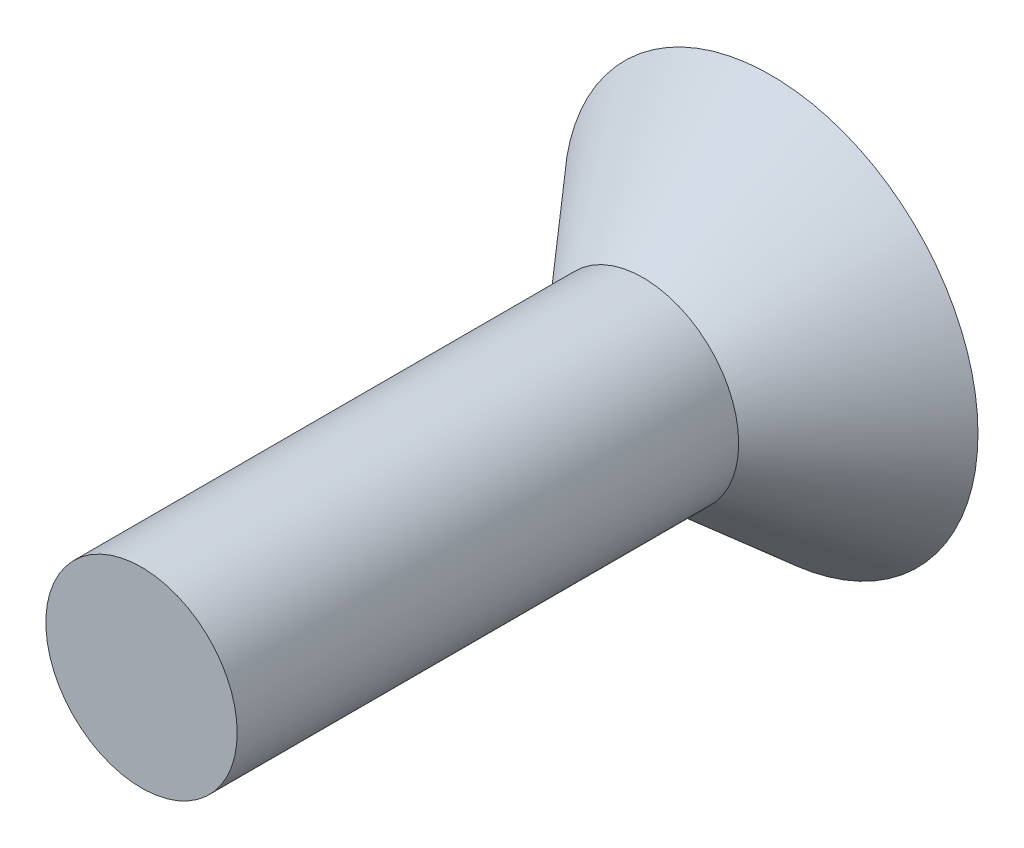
ISO-10303-21;
HEADER;
FILE_DESCRIPTION(('STEP AP214'),'2;1');
FILE_NAME('part.step','',(''),(''),'','','');
FILE_SCHEMA(('AUTOMOTIVE_DESIGN { 1 0 10303 214 1 1 1 1 }'));
ENDSEC;
DATA;
#1=APPLICATION_CONTEXT('core data for automotive mechanical design processes');
#2=APPLICATION_PROTOCOL_DEFINITION('international standard','automotive_design',2000,#1);
#3=PRODUCT_CONTEXT('',#1,'mechanical');
#4=PRODUCT('Part','Part','',(#3));
#5=PRODUCT_RELATED_PRODUCT_CATEGORY('part','',(#4));
#6=PRODUCT_DEFINITION_FORMATION('','',#4);
#7=PRODUCT_DEFINITION_CONTEXT('part definition',#1,'design');
#8=PRODUCT_DEFINITION('design','',#6,#7);
#9=PRODUCT_DEFINITION_SHAPE('','',#8);
#10=(LENGTH_UNIT() NAMED_UNIT(*) SI_UNIT(.MILLI.,.METRE.));
#11=(NAMED_UNIT(*) PLANE_ANGLE_UNIT() SI_UNIT($,.RADIAN.));
#12=(NAMED_UNIT(*) SI_UNIT($,.STERADIAN.) SOLID_ANGLE_UNIT());
#13=UNCERTAINTY_MEASURE_WITH_UNIT(LENGTH_MEASURE(1.E-05),#10,'distance_accuracy_value','');
#14=(GEOMETRIC_REPRESENTATION_CONTEXT(3) GLOBAL_UNCERTAINTY_ASSIGNED_CONTEXT((#13)) GLOBAL_UNIT_ASSIGNED_CONTEXT((#10,
#11,#12)) REPRESENTATION_CONTEXT('',''));
#15=CARTESIAN_POINT('',(0.,0.,0.));
#16=DIRECTION('',(0.,0.,1.));
#17=DIRECTION('',(1.,0.,0.));
#18=AXIS2_PLACEMENT_3D('',#15,#16,#17);
#19=CARTESIAN_POINT('',(0.,-5.2197,0.));
#20=DIRECTION('',(0.,0.,-1.));
#21=DIRECTION('',(-1.,0.,0.));
#22=AXIS2_PLACEMENT_3D('',#19,#20,#21);
#23=PLANE('',#22);
#24=DIRECTION('',(0.866025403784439,-0.5,0.));
#25=VECTOR('',#24,1.);
#26=CARTESIAN_POINT('',(0.,1.83308710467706,0.));
#27=LINE('',#26,#25);
#28=CARTESIAN_POINT('',(0.,1.83308710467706,0.));
#29=VERTEX_POINT('',#28);
#30=CARTESIAN_POINT('',(1.5875,0.916543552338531,0.));
#31=VERTEX_POINT('',#30);
#32=EDGE_CURVE('E46',#29,#31,#27,.T.);
#33=ORIENTED_EDGE('',*,*,#32,.F.);
#34=DIRECTION('',(0.866025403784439,0.5,0.));
#35=VECTOR('',#34,1.);
#36=CARTESIAN_POINT('',(-1.5875,0.916543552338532,0.));
#37=LINE('',#36,#35);
#38=CARTESIAN_POINT('',(-1.5875,0.916543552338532,0.));
#39=VERTEX_POINT('',#38);
#40=EDGE_CURVE('E129',#39,#29,#37,.T.);
#41=ORIENTED_EDGE('',*,*,#40,.F.);
#42=DIRECTION('',(0.,1.,0.));
#43=VECTOR('',#42,1.);
#44=CARTESIAN_POINT('',(-1.5875,-0.916543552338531,0.));
#45=LINE('',#44,#43);
#46=CARTESIAN_POINT('',(-1.5875,-0.916543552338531,0.));
#47=VERTEX_POINT('',#46);
#48=EDGE_CURVE('E127',#47,#39,#45,.T.);
#49=ORIENTED_EDGE('',*,*,#48,.F.);
#50=DIRECTION('',(-0.866025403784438,0.5,0.));
#51=VECTOR('',#50,1.);
#52=CARTESIAN_POINT('',(0.,-1.83308710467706,0.));
#53=LINE('',#52,#51);
#54=CARTESIAN_POINT('',(0.,-1.83308710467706,0.));
#55=VERTEX_POINT('',#54);
#56=EDGE_CURVE('E94',#55,#47,#53,.T.);
#57=ORIENTED_EDGE('',*,*,#56,.F.);
#58=DIRECTION('',(-0.866025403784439,-0.5,0.));
#59=VECTOR('',#58,1.);
#60=CARTESIAN_POINT('',(1.5875,-0.916543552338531,0.));
#61=LINE('',#60,#59);
#62=CARTESIAN_POINT('',(1.5875,-0.916543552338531,0.));
#63=VERTEX_POINT('',#62);
#64=EDGE_CURVE('E123',#63,#55,#61,.T.);
#65=ORIENTED_EDGE('',*,*,#64,.F.);
#66=DIRECTION('',(0.,-1.,0.));
#67=VECTOR('',#66,1.);
#68=CARTESIAN_POINT('',(1.5875,0.916543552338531,0.));
#69=LINE('',#68,#67);
#70=EDGE_CURVE('E120',#31,#63,#69,.T.);
#71=ORIENTED_EDGE('',*,*,#70,.F.);
#72=EDGE_LOOP('',(#33,#41,#49,#57,#65,#71));
#73=FACE_BOUND('',#72,.T.);
#74=CARTESIAN_POINT('',(0.,0.,0.));
#75=DIRECTION('',(0.,0.,1.));
#76=DIRECTION('',(1.,0.,0.));
#77=AXIS2_PLACEMENT_3D('',#74,#75,#76);
#78=CIRCLE('',#77,5.2197);
#79=CARTESIAN_POINT('',(5.2197,0.,0.));
#80=VERTEX_POINT('',#79);
#81=EDGE_CURVE('E11',#80,#80,#78,.T.);
#82=ORIENTED_EDGE('',*,*,#81,.F.);
#83=EDGE_LOOP('',(#82));
#84=FACE_BOUND('',#83,.T.);
#85=ADVANCED_FACE('F32',(#73,#84),#23,.T.);
#86=CARTESIAN_POINT('',(0.,0.,3.2287390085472));
#87=DIRECTION('',(0.,0.,-1.));
#88=DIRECTION('',(-1.,0.,0.));
#89=AXIS2_PLACEMENT_3D('',#86,#87,#88);
#90=CONICAL_SURFACE('',#89,2.413,0.715584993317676);
#91=ORIENTED_EDGE('',*,*,#81,.T.);
#92=EDGE_LOOP('',(#91));
#93=FACE_BOUND('',#92,.T.);
#94=CARTESIAN_POINT('',(0.,0.,3.2287390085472));
#95=DIRECTION('',(0.,0.,1.));
#96=DIRECTION('',(1.,0.,0.));
#97=AXIS2_PLACEMENT_3D('',#94,#95,#96);
#98=CIRCLE('',#97,2.413);
#99=CARTESIAN_POINT('',(2.413,0.,3.2287390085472));
#100=VERTEX_POINT('',#99);
#101=EDGE_CURVE('E39',#100,#100,#98,.T.);
#102=ORIENTED_EDGE('',*,*,#101,.F.);
#103=EDGE_LOOP('',(#102));
#104=FACE_BOUND('',#103,.T.);
#105=ADVANCED_FACE('F146',(#93,#104),#90,.T.);
#106=CARTESIAN_POINT('',(0.,0.,15.875));
#107=DIRECTION('',(0.,0.,1.));
#108=DIRECTION('',(1.,0.,0.));
#109=AXIS2_PLACEMENT_3D('',#106,#107,#108);
#110=CYLINDRICAL_SURFACE('',#109,2.413);
#111=ORIENTED_EDGE('',*,*,#101,.T.);
#112=EDGE_LOOP('',(#111));
#113=FACE_BOUND('',#112,.T.);
#114=CARTESIAN_POINT('',(0.,0.,15.875));
#115=DIRECTION('',(0.,0.,1.));
#116=DIRECTION('',(1.,0.,0.));
#117=AXIS2_PLACEMENT_3D('',#114,#115,#116);
#118=CIRCLE('',#117,2.413);
#119=CARTESIAN_POINT('',(2.413,0.,15.875));
#120=VERTEX_POINT('',#119);
#121=EDGE_CURVE('E133',#120,#120,#118,.T.);
#122=ORIENTED_EDGE('',*,*,#121,.F.);
#123=EDGE_LOOP('',(#122));
#124=FACE_BOUND('',#123,.T.);
#125=ADVANCED_FACE('F143',(#113,#124),#110,.T.);
#126=CARTESIAN_POINT('',(0.,0.,15.875));
#127=DIRECTION('',(0.,0.,1.));
#128=DIRECTION('',(1.,0.,0.));
#129=AXIS2_PLACEMENT_3D('',#126,#127,#128);
#130=PLANE('',#129);
#131=ORIENTED_EDGE('',*,*,#121,.T.);
#132=EDGE_LOOP('',(#131));
#133=FACE_BOUND('',#132,.T.);
#134=ADVANCED_FACE('F153',(#133),#130,.T.);
#135=CARTESIAN_POINT('',(0.,1.83308710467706,3.048));
#136=DIRECTION('',(0.5,0.866025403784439,0.));
#137=DIRECTION('',(-0.866025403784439,0.5,0.));
#138=AXIS2_PLACEMENT_3D('',#135,#136,#137);
#139=PLANE('',#138);
#140=ORIENTED_EDGE('',*,*,#32,.T.);
#141=DIRECTION('',(0.,0.,-1.));
#142=VECTOR('',#141,1.);
#143=CARTESIAN_POINT('',(1.5875,0.916543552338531,3.048));
#144=LINE('',#143,#142);
#145=CARTESIAN_POINT('',(1.5875,0.916543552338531,3.048));
#146=VERTEX_POINT('',#145);
#147=EDGE_CURVE('E76',#146,#31,#144,.T.);
#148=ORIENTED_EDGE('',*,*,#147,.F.);
#149=DIRECTION('',(0.866025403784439,-0.5,0.));
#150=VECTOR('',#149,1.);
#151=CARTESIAN_POINT('',(0.,1.83308710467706,3.048));
#152=LINE('',#151,#150);
#153=CARTESIAN_POINT('',(0.,1.83308710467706,3.048));
#154=VERTEX_POINT('',#153);
#155=EDGE_CURVE('E131',#154,#146,#152,.T.);
#156=ORIENTED_EDGE('',*,*,#155,.F.);
#157=DIRECTION('',(0.,0.,-1.));
#158=VECTOR('',#157,1.);
#159=CARTESIAN_POINT('',(0.,1.83308710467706,3.048));
#160=LINE('',#159,#158);
#161=EDGE_CURVE('E54',#154,#29,#160,.T.);
#162=ORIENTED_EDGE('',*,*,#161,.T.);
#163=EDGE_LOOP('',(#140,#148,#156,#162));
#164=FACE_BOUND('',#163,.T.);
#165=ADVANCED_FACE('F159',(#164),#139,.F.);
#166=CARTESIAN_POINT('',(-1.5875,0.916543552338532,3.048));
#167=DIRECTION('',(-0.5,0.866025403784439,0.));
#168=DIRECTION('',(-0.866025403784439,-0.5,0.));
#169=AXIS2_PLACEMENT_3D('',#166,#167,#168);
#170=PLANE('',#169);
#171=ORIENTED_EDGE('',*,*,#40,.T.);
#172=ORIENTED_EDGE('',*,*,#161,.F.);
#173=DIRECTION('',(0.866025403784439,0.5,0.));
#174=VECTOR('',#173,1.);
#175=CARTESIAN_POINT('',(-1.5875,0.916543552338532,3.048));
#176=LINE('',#175,#174);
#177=CARTESIAN_POINT('',(-1.5875,0.916543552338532,3.048));
#178=VERTEX_POINT('',#177);
#179=EDGE_CURVE('E106',#178,#154,#176,.T.);
#180=ORIENTED_EDGE('',*,*,#179,.F.);
#181=DIRECTION('',(0.,0.,-1.));
#182=VECTOR('',#181,1.);
#183=CARTESIAN_POINT('',(-1.5875,0.916543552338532,3.048));
#184=LINE('',#183,#182);
#185=EDGE_CURVE('E98',#178,#39,#184,.T.);
#186=ORIENTED_EDGE('',*,*,#185,.T.);
#187=EDGE_LOOP('',(#171,#172,#180,#186));
#188=FACE_BOUND('',#187,.T.);
#189=ADVANCED_FACE('F163',(#188),#170,.F.);
#190=CARTESIAN_POINT('',(-1.5875,-0.916543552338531,3.048));
#191=DIRECTION('',(-1.,0.,0.));
#192=DIRECTION('',(0.,-1.,0.));
#193=AXIS2_PLACEMENT_3D('',#190,#191,#192);
#194=PLANE('',#193);
#195=ORIENTED_EDGE('',*,*,#48,.T.);
#196=ORIENTED_EDGE('',*,*,#185,.F.);
#197=DIRECTION('',(0.,1.,0.));
#198=VECTOR('',#197,1.);
#199=CARTESIAN_POINT('',(-1.5875,-0.916543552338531,3.048));
#200=LINE('',#199,#198);
#201=CARTESIAN_POINT('',(-1.5875,-0.916543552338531,3.048));
#202=VERTEX_POINT('',#201);
#203=EDGE_CURVE('E102',#202,#178,#200,.T.);
#204=ORIENTED_EDGE('',*,*,#203,.F.);
#205=DIRECTION('',(0.,0.,-1.));
#206=VECTOR('',#205,1.);
#207=CARTESIAN_POINT('',(-1.5875,-0.916543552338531,3.048));
#208=LINE('',#207,#206);
#209=EDGE_CURVE('E87',#202,#47,#208,.T.);
#210=ORIENTED_EDGE('',*,*,#209,.T.);
#211=EDGE_LOOP('',(#195,#196,#204,#210));
#212=FACE_BOUND('',#211,.T.);
#213=ADVANCED_FACE('F103',(#212),#194,.F.);
#214=CARTESIAN_POINT('',(0.,-1.83308710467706,3.048));
#215=DIRECTION('',(-0.5,-0.866025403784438,0.));
#216=DIRECTION('',(0.866025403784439,-0.5,0.));
#217=AXIS2_PLACEMENT_3D('',#214,#215,#216);
#218=PLANE('',#217);
#219=ORIENTED_EDGE('',*,*,#56,.T.);
#220=ORIENTED_EDGE('',*,*,#209,.F.);
#221=DIRECTION('',(-0.866025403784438,0.5,0.));
#222=VECTOR('',#221,1.);
#223=CARTESIAN_POINT('',(0.,-1.83308710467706,3.048));
#224=LINE('',#223,#222);
#225=CARTESIAN_POINT('',(0.,-1.83308710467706,3.048));
#226=VERTEX_POINT('',#225);
#227=EDGE_CURVE('E91',#226,#202,#224,.T.);
#228=ORIENTED_EDGE('',*,*,#227,.F.);
#229=DIRECTION('',(0.,0.,-1.));
#230=VECTOR('',#229,1.);
#231=CARTESIAN_POINT('',(0.,-1.83308710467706,3.048));
#232=LINE('',#231,#230);
#233=EDGE_CURVE('E99',#226,#55,#232,.T.);
#234=ORIENTED_EDGE('',*,*,#233,.T.);
#235=EDGE_LOOP('',(#219,#220,#228,#234));
#236=FACE_BOUND('',#235,.T.);
#237=ADVANCED_FACE('F89',(#236),#218,.F.);
#238=CARTESIAN_POINT('',(1.5875,-0.916543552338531,3.048));
#239=DIRECTION('',(0.5,-0.866025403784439,0.));
#240=DIRECTION('',(0.866025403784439,0.5,0.));
#241=AXIS2_PLACEMENT_3D('',#238,#239,#240);
#242=PLANE('',#241);
#243=ORIENTED_EDGE('',*,*,#64,.T.);
#244=ORIENTED_EDGE('',*,*,#233,.F.);
#245=DIRECTION('',(-0.866025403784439,-0.5,0.));
#246=VECTOR('',#245,1.);
#247=CARTESIAN_POINT('',(1.5875,-0.916543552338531,3.048));
#248=LINE('',#247,#246);
#249=CARTESIAN_POINT('',(1.5875,-0.916543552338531,3.048));
#250=VERTEX_POINT('',#249);
#251=EDGE_CURVE('E112',#250,#226,#248,.T.);
#252=ORIENTED_EDGE('',*,*,#251,.F.);
#253=DIRECTION('',(0.,0.,-1.));
#254=VECTOR('',#253,1.);
#255=CARTESIAN_POINT('',(1.5875,-0.916543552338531,3.048));
#256=LINE('',#255,#254);
#257=EDGE_CURVE('E136',#250,#63,#256,.T.);
#258=ORIENTED_EDGE('',*,*,#257,.T.);
#259=EDGE_LOOP('',(#243,#244,#252,#258));
#260=FACE_BOUND('',#259,.T.);
#261=ADVANCED_FACE('F167',(#260),#242,.F.);
#262=CARTESIAN_POINT('',(1.5875,0.916543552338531,3.048));
#263=DIRECTION('',(1.,0.,0.));
#264=DIRECTION('',(0.,0.,-1.));
#265=AXIS2_PLACEMENT_3D('',#262,#263,#264);
#266=PLANE('',#265);
#267=ORIENTED_EDGE('',*,*,#70,.T.);
#268=ORIENTED_EDGE('',*,*,#257,.F.);
#269=DIRECTION('',(0.,-1.,0.));
#270=VECTOR('',#269,1.);
#271=CARTESIAN_POINT('',(1.5875,0.916543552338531,3.048));
#272=LINE('',#271,#270);
#273=EDGE_CURVE('E114',#146,#250,#272,.T.);
#274=ORIENTED_EDGE('',*,*,#273,.F.);
#275=ORIENTED_EDGE('',*,*,#147,.T.);
#276=EDGE_LOOP('',(#267,#268,#274,#275));
#277=FACE_BOUND('',#276,.T.);
#278=ADVANCED_FACE('F164',(#277),#266,.F.);
#279=CARTESIAN_POINT('',(3.175,0.,3.048));
#280=DIRECTION('',(0.,0.,-1.));
#281=DIRECTION('',(-1.,0.,0.));
#282=AXIS2_PLACEMENT_3D('',#279,#280,#281);
#283=PLANE('',#282);
#284=ORIENTED_EDGE('',*,*,#155,.T.);
#285=ORIENTED_EDGE('',*,*,#273,.T.);
#286=ORIENTED_EDGE('',*,*,#251,.T.);
#287=ORIENTED_EDGE('',*,*,#227,.T.);
#288=ORIENTED_EDGE('',*,*,#203,.T.);
#289=ORIENTED_EDGE('',*,*,#179,.T.);
#290=EDGE_LOOP('',(#284,#285,#286,#287,#288,#289));
#291=FACE_BOUND('',#290,.T.);
#292=ADVANCED_FACE('F109',(#291),#283,.T.);
#293=CLOSED_SHELL('',(#85,#105,#125,#134,#165,#189,#213,#237,#261,#278,#292));
#294=MANIFOLD_SOLID_BREP('B2',#293);
#295=ADVANCED_BREP_SHAPE_REPRESENTATION('',(#18,#294),#14);
#296=SHAPE_DEFINITION_REPRESENTATION(#9,#295);
ENDSEC;
END-ISO-10303-21;
